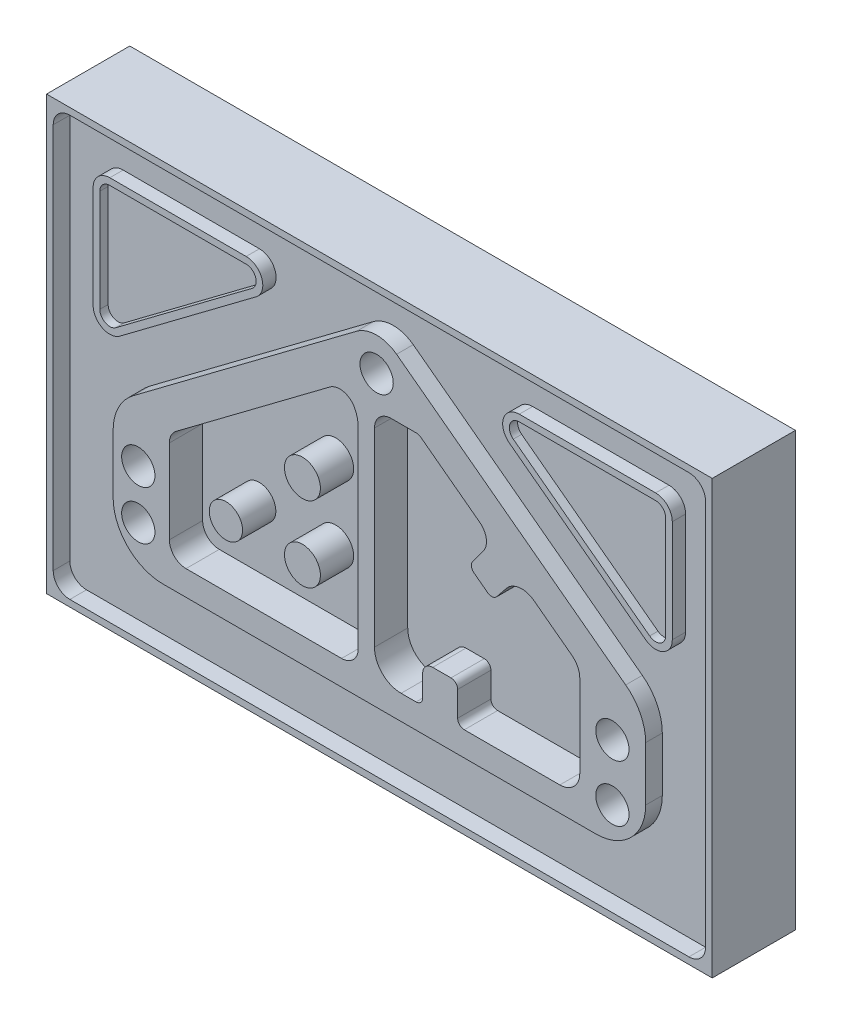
from build123d import *

# Parameters (mm, degrees)
BASE_TRIANGLE_DEPTH  = 50
SKETCH5_W            = 400
SKETCH5_H            = 260
BASE_RECTANGLE_DEPTH = 40
POCKETS_DEPTH        = 20
SKETCH3_R            = 10
CUT_HOLES_DEPTH      = 40
SKETCH4_R            = 10.786602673
SKETCH4_R_2          = 10
POCKET_BOSS_DEPTH    = 20
SKETCH6_W            = 400
SKETCH6_H            = 260
RIM_DEPTH            = 10
TRI_BOSS_DEPTH       = 8
TRI_POCK_S_DEPTH     = 5


with BuildPart() as part:
    # Sketch1 → Base - Triangle (new body)
    with BuildSketch(Plane.XY):
        with BuildLine():
            Line((-13.666666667, 109.75), (-148, 9))
            ThreePointArc((-148, 9), (-156.83281573, -1.583592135), (-160, -15))
            Line((-160, -15), (-160, -50))
            ThreePointArc((-160, -50), (-151.213203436, -71.213203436), (-130, -80))
            Line((-130, -80), (130, -80))
            ThreePointArc((130, -80), (151.213203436, -71.213203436), (160, -50))
            Line((160, -50), (160, -17.5))
            ThreePointArc((160, -17.5), (156.83281573, -4.083592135), (148, 6.5))
            Line((148, 6.5), (10.333333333, 109.75))
            ThreePointArc((10.333333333, 109.75), (-1.666666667, 113.75), (-13.666666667, 109.75))
        make_face()
    extrude(amount=BASE_TRIANGLE_DEPTH)

    # Sketch5 → Base - Rectangle (add)
    with BuildSketch(Plane.XY):
        with Locations((0, 10)):
            Rectangle(SKETCH5_W, SKETCH5_H)
    extrude(amount=BASE_RECTANGLE_DEPTH)

    # Sketch2 → Pockets (cut)
    with BuildSketch(Plane.XY.offset(50)):
        with BuildLine():
            Line((-126.20392244, -4.65294183), (-126.20392244, -55.061436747))
            ThreePointArc((-126.20392244, -55.061436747), (-123.274990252, -62.132504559), (-116.20392244, -65.061436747))
            Line((-116.20392244, -65.061436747), (-22.729187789, -65.061436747))
            ThreePointArc((-22.729187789, -65.061436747), (-15.658119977, -62.132504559), (-12.729187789, -55.061436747))
            Line((-12.729187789, -55.061436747), (-12.729187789, 60.20056332))
            ThreePointArc((-12.729187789, 60.20056332), (-13.262082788, 64.786609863), (-14.832370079, 69.12826828))
            ThreePointArc((-14.832370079, 69.12826828), (-21.478744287, 74.395841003), (-29.780778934, 72.6644158))
            Line((-29.780778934, 72.6644158), (-122.20392244, 3.34705817))
            ThreePointArc((-122.20392244, 3.34705817), (-125.14819435, -0.180805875), (-126.20392244, -4.65294183))
        make_face()
        with BuildLine():
            Line((-2.969097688, 64.72393548), (-2.969097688, -49.319676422))
            ThreePointArc((-2.969097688, -49.319676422), (1.717193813, -60.633384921), (13.030902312, -65.319676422))
            Line((13.030902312, -65.319676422), (22.011923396, -65.319676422))
            ThreePointArc((22.011923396, -65.319676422), (24.840350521, -64.148103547), (26.011923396, -61.319676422))
            Line((26.011923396, -61.319676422), (26.011923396, -48.319676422))
            ThreePointArc((26.011923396, -48.319676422), (27.769282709, -44.077035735), (32.011923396, -42.319676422))
            Line((32.011923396, -42.319676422), (43.011923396, -42.319676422))
            ThreePointArc((43.011923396, -42.319676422), (45.840350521, -43.491249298), (47.011923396, -46.319676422))
            Line((47.011923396, -46.319676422), (47.011923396, -61.319676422))
            ThreePointArc((47.011923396, -61.319676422), (48.183496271, -64.148103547), (51.011923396, -65.319676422))
            Line((51.011923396, -65.319676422), (108.417947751, -65.319676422))
            ThreePointArc((108.417947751, -65.319676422), (116.903229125, -61.804957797), (120.417947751, -53.319676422))
            Line((120.417947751, -53.319676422), (120.417947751, -3.813460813))
            ThreePointArc((120.417947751, -3.813460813), (119.151074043, 1.553102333), (115.617947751, 5.786539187))
            Line((115.617947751, 5.786539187), (92.782280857, 22.913289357))
            ThreePointArc((92.782280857, 22.913289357), (84.071541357, 25.217812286), (76.212563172, 20.810514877))
            Line((76.212563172, 20.810514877), (70.571566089, 13.760633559))
            ThreePointArc((70.571566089, 13.760633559), (67.951906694, 12.291534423), (65.04832686, 13.059708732))
            Line((65.04832686, 13.059708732), (56.830014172, 19.223443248))
            ThreePointArc((56.830014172, 19.223443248), (55.270216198, 21.857757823), (56.030014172, 24.823443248))
            Line((56.030014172, 24.823443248), (62.343956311, 33.242032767))
            ThreePointArc((62.343956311, 33.242032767), (64.243451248, 40.656246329), (60.343956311, 47.242032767))
            Line((60.343956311, 47.242032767), (24.768086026, 73.92393548))
            ThreePointArc((24.768086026, 73.92393548), (23.63299709, 74.518668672), (22.368086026, 74.72393548))
            Line((22.368086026, 74.72393548), (7.030902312, 74.72393548))
            ThreePointArc((7.030902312, 74.72393548), (-0.0401655, 71.795003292), (-2.969097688, 64.72393548))
        make_face()
    extrude(amount=-POCKETS_DEPTH, mode=Mode.SUBTRACT)

    # Sketch3 → Cut - Holes (cut)
    with BuildSketch(Plane.XY.offset(50)):
        with Locations((-144.880429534, -26.083370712)):
            Circle(SKETCH3_R)
        with Locations((-144.880429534, -55.454261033)):
            Circle(SKETCH3_R)
        with Locations((140, -26.083370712)):
            Circle(SKETCH3_R)
        with Locations((140, -60)):
            Circle(SKETCH3_R)
        with Locations((-1.666666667, 93.75)):
            Circle(SKETCH3_R)
    extrude(amount=-CUT_HOLES_DEPTH, mode=Mode.SUBTRACT)

    # Sketch4 → Pocket Boss (add)
    with BuildSketch(Plane.XY.offset(30)):
        with Locations(Location((-46.246176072, 17.161613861, 0), (0, 0, 180))):
            Circle(SKETCH4_R)
        with Locations(Location((-46.246176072, -28.171767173, 0), (0, 0, 180))):
            Circle(SKETCH4_R)
        with Locations(Location((-92.222494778, -28.171767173, 0), (0, 0, 180))):
            Circle(SKETCH4_R_2)
    extrude(amount=POCKET_BOSS_DEPTH)

    # Sketch6 → Rim (add)
    with BuildSketch(Plane.XY.offset(40)):
        with Locations((0, 10)):
            Rectangle(SKETCH6_W, SKETCH6_H)
        with BuildLine():
            Line((-196, 126), (-196, -106))
            ThreePointArc((-196, -106), (-193.071067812, -113.071067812), (-186, -116))
            Line((-186, -116), (186, -116))
            ThreePointArc((186, -116), (193.071067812, -113.071067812), (196, -106))
            Line((196, -106), (196, 126))
            ThreePointArc((196, 126), (193.071067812, 133.071067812), (186, 136))
            Line((186, 136), (-186, 136))
            ThreePointArc((-186, 136), (-193.071067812, 133.071067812), (-196, 126))
        make_face(mode=Mode.SUBTRACT)
    extrude(amount=RIM_DEPTH)

    # Sketch7 → Tri - Boss (add)
    with BuildSketch(Plane.XY.offset(40)):
        with BuildLine():
            Line((-164, 113.448068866), (-82.069241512, 113.448068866))
            ThreePointArc((-82.069241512, 113.448068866), (-72.582408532, 106.610346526), (-76.069241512, 95.448068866))
            Line((-76.069241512, 95.448068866), (-158, 34))
            ThreePointArc((-158, 34), (-168.472135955, 33.05572809), (-174, 42))
            Line((-174, 42), (-174, 103.448068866))
            ThreePointArc((-174, 103.448068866), (-171.071067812, 110.519136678), (-164, 113.448068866))
        make_face()
        with BuildLine():
            Line((158, 34), (76.069241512, 95.448068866))
            ThreePointArc((76.069241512, 95.448068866), (72.582408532, 106.610346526), (82.069241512, 113.448068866))
            Line((82.069241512, 113.448068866), (164, 113.448068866))
            ThreePointArc((164, 113.448068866), (171.071067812, 110.519136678), (174, 103.448068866))
            Line((174, 103.448068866), (174, 42))
            ThreePointArc((174, 42), (168.472135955, 33.05572809), (158, 34))
        make_face()
    extrude(amount=TRI_BOSS_DEPTH)

    # Sketch8 → Tri - Pock_s (cut)
    with BuildSketch(Plane.XY.offset(48)):
        with BuildLine():
            Line((-82.069241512, 109.448068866), (-164, 109.448068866))
            ThreePointArc((-164, 109.448068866), (-168.242640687, 107.690709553), (-170, 103.448068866))
            Line((-170, 103.448068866), (-170, 42))
            ThreePointArc((-170, 42), (-166.683281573, 36.633436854), (-160.4, 37.2))
            Line((-160.4, 37.2), (-78.469241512, 98.648068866))
            ThreePointArc((-78.469241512, 98.648068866), (-76.377141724, 105.345435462), (-82.069241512, 109.448068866))
        make_face()
        with BuildLine():
            Line((170, 42), (170, 103.448068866))
            ThreePointArc((170, 103.448068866), (168.242640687, 107.690709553), (164, 109.448068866))
            Line((164, 109.448068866), (82.069241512, 109.448068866))
            ThreePointArc((82.069241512, 109.448068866), (76.377141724, 105.345435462), (78.469241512, 98.648068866))
            Line((78.469241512, 98.648068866), (160.4, 37.2))
            ThreePointArc((160.4, 37.2), (166.683281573, 36.633436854), (170, 42))
        make_face()
    extrude(amount=-TRI_POCK_S_DEPTH, mode=Mode.SUBTRACT)


solid = part.part
